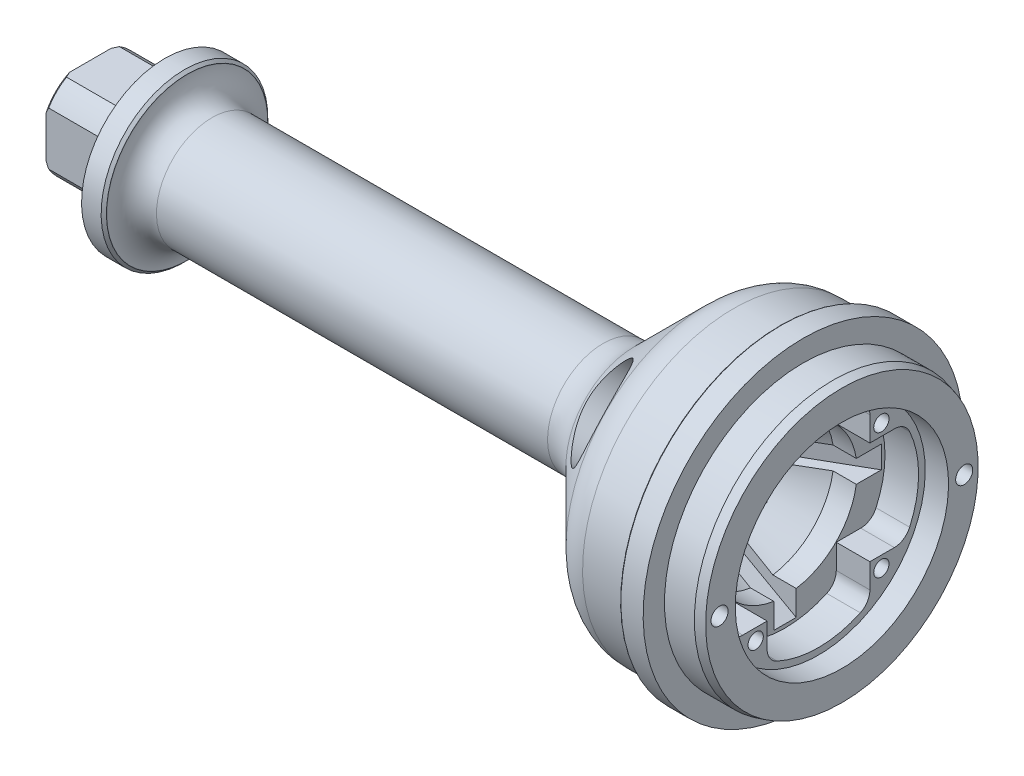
from build123d import *

# Parameters (mm, degrees)
BOSS_EXTRUDE1_DEPTH      = 10.668
SKETCH4_R                = 11.049
SKETCH4_R_2              = 8.636
CUT_EXTRUDE1_DEPTH       = 1.27
CHAMFER1_SIZE            = 0.381
CUT_EXTRUDE3_DEPTH       = 2.413
CUT_EXTRUDE3_DEPTH_BACK  = 2.413
FILLET1_R                = 2.286
CUT_EXTRUDE4_DEPTH       = 99.563879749
CUT_EXTRUDE4_DEPTH_BACK  = 0.1016
SKETCH14_R               = 6.35
SKETCH17_R               = 5.1562
CUT_EXTRUDE6_DEPTH       = 113.151812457
CHAMFER2_SIZE            = 0.381
SKETCH18_R               = 10.3124
CUT_EXTRUDE7_DEPTH       = 11.4554
SKETCH19_R               = 10.3124
CUT_EXTRUDE8_DEPTH       = 11.4554
CUT_EXTRUDE8_DRAFT       = -30
SKETCH20_R               = 15.24
CUT_EXTRUDE9_DEPTH       = 3.3274
CUT_EXTRUDE10_DEPTH      = 8.128
SKETCH22_R               = 1.0922
CUT_EXTRUDE11_DEPTH      = 7.112
SKETCH23_R               = 1.2192
CUT_EXTRUDE12_DEPTH      = 6.731
CUT_EXTRUDE13_DEPTH      = 1.6002
CUT_EXTRUDE13_DEPTH_BACK = 1.6002
CUT_EXTRUDE14_DEPTH      = 1.6002
CUT_EXTRUDE14_DEPTH_BACK = 1.6002
CHAMFER3_SIZE            = 0.340295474
CHAMFER3_SIZE2           = 1.27
FILLET3_R                = 0.381
FILLET4_R                = 0.127
SKETCH26_R               = 6.35
BOSS_EXTRUDE2_DEPTH      = 0.0508
SKETCH27_W               = 12.433704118
SKETCH27_H               = 2.57302
FILLET8_R                = 5.715
FILLET9_R                = 0.127
CUT_EXTRUDE15_DEPTH      = 0.8128
CUT_EXTRUDE15_DEPTH_BACK = 0.8128


with BuildPart() as part:
    # Sketch2 → Base-Revolve (revolve)
    with BuildSketch(Plane.XY):
        with BuildLine():
            Line((5.5372, 19.812), (0, 19.812))
            Line((0, 19.812), (0, 22.86))
            Line((0, 22.86), (-8.393343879, 22.86))
            ThreePointArc((-8.393343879, 22.86), (-10.823383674, 22.376635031), (-12.883471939, 21.000128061))
            Line((-12.883471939, 21.000128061), (-24.086228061, 9.797371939))
            ThreePointArc((-24.086228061, 9.797371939), (-26.146316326, 8.420864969), (-28.576356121, 7.9375))
            Line((-28.576356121, 7.9375), (-84.455, 7.9375))
            ThreePointArc((-84.455, 7.9375), (-86.969471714, 8.979028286), (-88.011, 11.4935))
            Line((-88.011, 11.4935), (-88.011, 11.5316))
            Line((-88.011, 11.5316), (-88.392, 11.9126))
            Line((-88.392, 11.9126), (-91.186, 11.9126))
            Line((-91.186, 11.9126), (-91.186, 0))
            Line((-91.186, 0), (5.5372, 0))
            Line((5.5372, 0), (5.5372, 19.812))
        make_face()
    revolve(axis=Axis((0, 0, 0), (-1, 0, 0)))

    # Sketch3 → Boss-Extrude1 (add)
    with BuildSketch(Plane.ZY.offset(91.186)):
        with BuildLine():
            Line((6.3246, 3.775896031), (6.3246, -3.775896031))
            ThreePointArc((6.3246, -3.775896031), (5.20854855, -5.20854855), (3.775896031, -6.3246))
            Line((3.775896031, -6.3246), (-3.775896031, -6.3246))
            ThreePointArc((-3.775896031, -6.3246), (-5.20854855, -5.20854855), (-6.3246, -3.775896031))
            Line((-6.3246, -3.775896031), (-6.3246, 3.775896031))
            ThreePointArc((-6.3246, 3.775896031), (-5.20854855, 5.20854855), (-3.775896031, 6.3246))
            Line((-3.775896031, 6.3246), (3.775896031, 6.3246))
            ThreePointArc((3.775896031, 6.3246), (5.20854855, 5.20854855), (6.3246, 3.775896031))
        make_face()
    extrude(amount=BOSS_EXTRUDE1_DEPTH)

    # Sketch4 → Cut-Extrude1 (cut)
    with BuildSketch(Plane.ZY.offset(91.186)):
        with Locations(Location((0, 0, 0), (0, 0, 270))):
            Circle(SKETCH4_R)
        with Locations(Location((0, 0, 0), (0, 0, 270))):
            Circle(SKETCH4_R_2, mode=Mode.SUBTRACT)
    extrude(amount=-CUT_EXTRUDE1_DEPTH, mode=Mode.SUBTRACT)

    # Chamfer1
    chamfer1_edges = [part.edges().sort_by_distance(p)[0] for p in [
        (-101.854, -5.20854855, -5.20854855),
        (-101.854, -5.20854855, 5.20854855),
        (-101.854, 5.20854855, 5.20854855),
        (-101.854, 5.20854855, -5.20854855),
    ]]
    chamfer(chamfer1_edges, length=CHAMFER1_SIZE)

    # Sketch12 → Cut-Extrude3 (cut, two sides: drawn at the far end of the back side and taken through both)
    with BuildSketch(Plane(origin=(0, -0.376326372, 0.376326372), x_dir=(-1, 0, 0), z_dir=(0, 0.7071067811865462, -0.7071067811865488)).offset(-CUT_EXTRUDE3_DEPTH_BACK)):
        Polygon((14.312622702, 16.338273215), (19.434965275, 21.351271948), (24.400008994, 16.277930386), (19.277666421, 11.264931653), (18.522483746, 12.03658642), (4.779648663, -1.706248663), (1.367151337, 1.706248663), (15.146801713, 15.485899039), align=None)
    extrude(amount=CUT_EXTRUDE3_DEPTH + CUT_EXTRUDE3_DEPTH_BACK, mode=Mode.SUBTRACT)

    # Fillet1
    fillet1_edges = [part.edges().sort_by_distance(p)[0] for p in [
        (-8.256976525, 3.995767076, 8.160917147),
        (-11.651066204, 1.569750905, 5.734900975),
        (-8.256976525, 7.408264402, 4.748419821),
        (-11.651066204, 4.982248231, 2.322403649),
    ]]
    fillet(fillet1_edges, radius=FILLET1_R)

    # Sketch14 → Cut-Extrude4 (cut, two sides: drawn at the far end of the back side and taken through both)
    with BuildSketch(Plane(origin=(-15.477938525, 10.710927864, 10.710927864), x_dir=(0.4066935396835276, -0.28143703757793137, 0.8691337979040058), z_dir=(-0.7146937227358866, 0.49457703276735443, 0.4945770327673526)).offset(-CUT_EXTRUDE4_DEPTH_BACK)):
        with Locations(Location((-0.808697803, -2.046826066, 0), (0, 0, 234.512341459))):
            Circle(SKETCH14_R)
    extrude(amount=CUT_EXTRUDE4_DEPTH + CUT_EXTRUDE4_DEPTH_BACK, mode=Mode.SUBTRACT)

    # Sketch17 → Cut-Extrude6 (cut, through all)
    with BuildSketch(Plane.ZY.offset(101.854)):
        with Locations(Location((0, 0, 0), (0, 0, 270))):
            Circle(SKETCH17_R)
    extrude(amount=-CUT_EXTRUDE6_DEPTH, mode=Mode.SUBTRACT)

    # Chamfer2
    chamfer2_edges = [part.edges().sort_by_distance(p)[0] for p in [
        (-101.854, 5.1562, 0),
    ]]
    chamfer(chamfer2_edges, length=CHAMFER2_SIZE)

    # Sketch18 → Cut-Extrude7 (cut)
    with BuildSketch(Plane(origin=(5.5372, 0, 0), x_dir=(0, 0, -1), z_dir=(1, 0, 0))):
        with Locations(Location((0, 0, 0), (0, 0, 90))):
            Circle(SKETCH18_R)
    extrude(amount=-CUT_EXTRUDE7_DEPTH, mode=Mode.SUBTRACT)


with BuildPart() as cut_extrude8_tool:
    # Sketch19 → Cut-Extrude8 (with draft: the straight prism first)
    with BuildSketch(Plane(origin=(-5.9182, 0, 0), x_dir=(0, 0, -1), z_dir=(1, 0, 0))):
        with Locations(Location((0, 0, 0), (0, 0, 90))):
            Circle(SKETCH19_R)
    extrude(amount=-CUT_EXTRUDE8_DEPTH)
    # Cut-Extrude8: the draft: its side faces are tilted about the plane it starts from
    cut_extrude8_sides = [cut_extrude8_tool.faces().sort_by_distance(p)[0] for p in [
        (-11.6459, -10.3124, 0),
    ]]
    draft(cut_extrude8_sides, Plane(origin=(-5.9182, 0, 0), x_dir=(0, 0, -1), z_dir=(1, 0, 0)), CUT_EXTRUDE8_DRAFT)


with BuildPart() as part_1:
    add(part.part)

    # Cut-Extrude8: cut by cut_extrude8_tool
    add(cut_extrude8_tool.part, mode=Mode.SUBTRACT)

    # Sketch20 → Cut-Extrude9 (cut)
    with BuildSketch(Plane(origin=(5.5372, 0, 0), x_dir=(0, 0, -1), z_dir=(1, 0, 0))):
        with Locations(Location((0, 0, 0), (0, 0, 90))):
            Circle(SKETCH20_R)
    extrude(amount=-CUT_EXTRUDE9_DEPTH, mode=Mode.SUBTRACT)

    # Sketch21 → Cut-Extrude10 (cut)
    with BuildSketch(Plane(origin=(5.5372, 0, 0), x_dir=(0, 0, -1), z_dir=(1, 0, 0))):
        with BuildLine():
            Line((7.326289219, -10.834710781), (7.326289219, -7.3406))
            Line((7.326289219, -7.3406), (10.8204, -7.3406))
            ThreePointArc((10.8204, -7.3406), (12.125829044, -6.952122), (13.00645455, -5.913103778))
            ThreePointArc((13.00645455, -5.913103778), (14.2875, 0), (13.00645455, 5.913103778))
            ThreePointArc((13.00645455, 5.913103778), (12.125829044, 6.952122), (10.8204, 7.3406))
            Line((10.8204, 7.3406), (7.326289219, 7.3406))
            Line((7.326289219, 7.3406), (7.326289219, 10.834710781))
            ThreePointArc((7.326289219, 10.834710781), (6.937811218, 12.140139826), (5.898792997, 13.020765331))
            ThreePointArc((5.898792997, 13.020765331), (-0.051186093, 14.301763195), (-5.994473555, 12.990069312))
            ThreePointArc((-5.994473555, 12.990069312), (-6.98635605, 12.109108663), (-7.354910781, 10.834710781))
            Line((-7.354910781, 10.834710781), (-7.354910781, 7.3406))
            Line((-7.354910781, 7.3406), (-10.849021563, 7.3406))
            ThreePointArc((-10.849021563, 7.3406), (-12.154450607, 6.952122), (-13.035076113, 5.913103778))
            ThreePointArc((-13.035076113, 5.913103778), (-14.316073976, -0.036875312), (-13.004380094, -5.980162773))
            ThreePointArc((-13.004380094, -5.980162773), (-12.123419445, -6.972045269), (-10.849021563, -7.3406))
            Line((-10.849021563, -7.3406), (-7.354910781, -7.3406))
            Line((-7.354910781, -7.3406), (-7.354910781, -10.834710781))
            ThreePointArc((-7.354910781, -10.834710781), (-6.966432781, -12.140139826), (-5.927414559, -13.020765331))
            ThreePointArc((-5.927414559, -13.020765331), (0.02256453, -14.301763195), (5.965851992, -12.990069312))
            ThreePointArc((5.965851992, -12.990069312), (6.957734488, -12.109108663), (7.326289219, -10.834710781))
        make_face()
    extrude(amount=-CUT_EXTRUDE10_DEPTH, mode=Mode.SUBTRACT)

    # Sketch22 → Cut-Extrude11 (cut)
    with BuildSketch(Plane(origin=(2.2098, 0, 0), x_dir=(0, 0, -1), z_dir=(1, 0, 0))):
        with Locations(Location((-8.9916, 8.9916, 0), (0, 0, 90))):
            Circle(SKETCH22_R)
        with Locations(Location((8.968912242, 8.9916, 0), (0, 0, 90))):
            Circle(SKETCH22_R)
        with Locations(Location((8.968912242, -8.968912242, 0), (0, 0, 90))):
            Circle(SKETCH22_R)
        with Locations(Location((-8.9916, -8.968912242, 0), (0, 0, 90))):
            Circle(SKETCH22_R)
    extrude(amount=-CUT_EXTRUDE11_DEPTH, mode=Mode.SUBTRACT)

    # Sketch23 → Cut-Extrude12 (cut)
    with BuildSketch(Plane(origin=(5.5372, 0, 0), x_dir=(0, 0, -1), z_dir=(1, 0, 0))):
        with Locations(Location((17.4752, 0, 0), (0, 0, 90))):
            Circle(SKETCH23_R)
        with Locations(Location((-17.4752, 0, 0), (0, 0, 90))):
            Circle(SKETCH23_R)
    extrude(amount=-CUT_EXTRUDE12_DEPTH, mode=Mode.SUBTRACT)

    # Sketch24 → Cut-Extrude13 (cut, two sides: drawn at the far end of the back side and taken through both)
    with BuildSketch(Plane.XY.offset(-CUT_EXTRUDE13_DEPTH_BACK)):
        Polygon((-2.202443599, -8.968912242), (-2.202443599, -13.996921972), (-19.90942414, -4.101844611), (-13.843713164, -4.101844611), align=None)
        Polygon((-2.202443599, 8.968912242), (-13.843713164, 4.101844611), (-19.90942414, 4.101844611), (-2.202443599, 13.996921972), align=None)
    extrude(amount=CUT_EXTRUDE13_DEPTH + CUT_EXTRUDE13_DEPTH_BACK, mode=Mode.SUBTRACT)

    # Sketch25 → Cut-Extrude14 (cut, two sides: drawn at the far end of the back side and taken through both)
    with BuildSketch(Plane(origin=(0, 0, 0), x_dir=(1, 0, 0), z_dir=(0, 1, 0)).offset(-CUT_EXTRUDE14_DEPTH_BACK)):
        Polygon((-16.27180801, -2.786695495), (-21.827545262, -2.786695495), (-2.527841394, -13.795083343), (-2.527841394, -6.48887325), align=None)
        Polygon((-21.827545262, 2.786695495), (-2.527841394, 13.795083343), (-2.527841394, 6.48887325), (-16.27180801, 2.786695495), align=None)
    extrude(amount=CUT_EXTRUDE14_DEPTH + CUT_EXTRUDE14_DEPTH_BACK, mode=Mode.SUBTRACT)

    # Chamfer3
    chamfer3_edges = [part_1.edges().sort_by_distance(p)[0] for p in [
        (5.5372, -19.812, 0),
    ]]
    chamfer3_side = [part_1.faces().sort_by_distance(p)[0] for p in [
        (5.5372, -19.251632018, 0),
    ]]
    chamfer(chamfer3_edges, length=CHAMFER3_SIZE, length2=CHAMFER3_SIZE2, reference=chamfer3_side[0])

    # Fillet3
    fillet3_edges = [part_1.edges().sort_by_distance(p)[0] for p in [
        (-89.916, 11.049, 0),
        (-89.916, 8.636, 0),
    ]]
    fillet(fillet3_edges, radius=FILLET3_R)

    # Fillet4
    fillet4_edges = [part_1.edges().sort_by_distance(p)[0] for p in [
        (-91.186, 11.049, 0),
        (-91.186, 8.636, 0),
    ]]
    fillet(fillet4_edges, radius=FILLET4_R)

    # Sketch26 → Boss-Extrude2 (add)
    with BuildSketch(Plane(origin=(-15.405325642, 10.660678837, 10.660678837), x_dir=(0.40669353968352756, -0.28143703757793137, 0.8691337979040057), z_dir=(-0.7146937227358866, 0.49457703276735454, 0.4945770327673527))):
        with Locations((-0.854759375, -2.038191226)):
            Circle(SKETCH26_R)
    extrude(amount=BOSS_EXTRUDE2_DEPTH)

    # Sketch27 → Cut-Revolve1 (revolve, cut)
    with BuildSketch(Plane.XY):
        with Locations((-9.518852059, 22.87651)):
            Rectangle(SKETCH27_W, SKETCH27_H)
    revolve(axis=Axis((0, 0, 0), (-1, 0, 0)), mode=Mode.SUBTRACT)

    # Fillet8
    fillet8_edges = [part_1.edges().sort_by_distance(p)[0] for p in [
        (-12.203343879, -21.59, 0),
    ]]
    fillet(fillet8_edges, radius=FILLET8_R)

    # Fillet9
    fillet9_edges = [part_1.edges().sort_by_distance(p)[0] for p in [
        (-3.302, -22.86, 0),
        (-3.302, -21.59, 0),
    ]]
    fillet(fillet9_edges, radius=FILLET9_R)

    # Sketch15 → Cut-Extrude15 (cut, two sides: drawn at the far end of the back side and taken through both)
    with BuildSketch(Plane.XY.offset(-CUT_EXTRUDE15_DEPTH_BACK)):
        Polygon((-18.846508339, -18.288), (-14.368133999, -18.288), (-8.148169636, -24.745879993), (-12.95827541, -24.745879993), align=None)
    extrude(amount=CUT_EXTRUDE15_DEPTH + CUT_EXTRUDE15_DEPTH_BACK, mode=Mode.SUBTRACT)


solid = part_1.part
